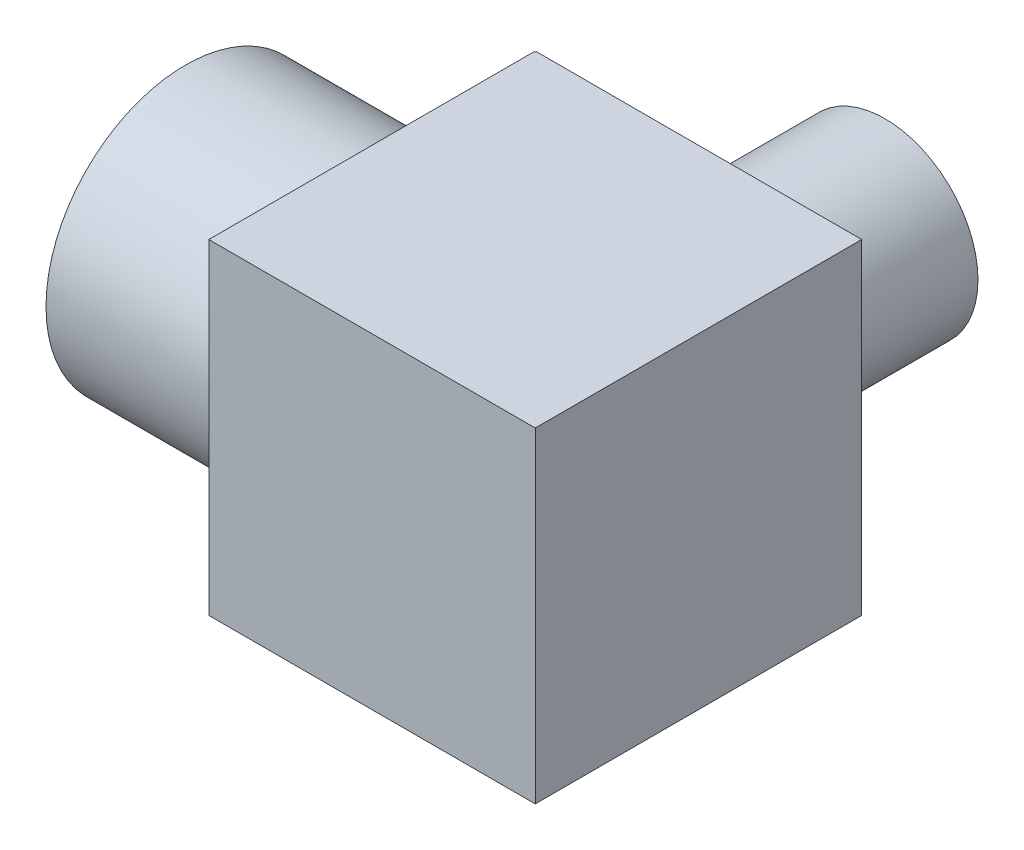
ISO-10303-21;
HEADER;
FILE_DESCRIPTION(('STEP AP214'),'2;1');
FILE_NAME('part.step','',(''),(''),'','','');
FILE_SCHEMA(('AUTOMOTIVE_DESIGN { 1 0 10303 214 1 1 1 1 }'));
ENDSEC;
DATA;
#1=APPLICATION_CONTEXT('core data for automotive mechanical design processes');
#2=APPLICATION_PROTOCOL_DEFINITION('international standard','automotive_design',2000,#1);
#3=PRODUCT_CONTEXT('',#1,'mechanical');
#4=PRODUCT('Part','Part','',(#3));
#5=PRODUCT_RELATED_PRODUCT_CATEGORY('part','',(#4));
#6=PRODUCT_DEFINITION_FORMATION('','',#4);
#7=PRODUCT_DEFINITION_CONTEXT('part definition',#1,'design');
#8=PRODUCT_DEFINITION('design','',#6,#7);
#9=PRODUCT_DEFINITION_SHAPE('','',#8);
#10=(LENGTH_UNIT() NAMED_UNIT(*) SI_UNIT(.MILLI.,.METRE.));
#11=(NAMED_UNIT(*) PLANE_ANGLE_UNIT() SI_UNIT($,.RADIAN.));
#12=(NAMED_UNIT(*) SI_UNIT($,.STERADIAN.) SOLID_ANGLE_UNIT());
#13=UNCERTAINTY_MEASURE_WITH_UNIT(LENGTH_MEASURE(1.E-05),#10,'distance_accuracy_value','');
#14=(GEOMETRIC_REPRESENTATION_CONTEXT(3) GLOBAL_UNCERTAINTY_ASSIGNED_CONTEXT((#13)) GLOBAL_UNIT_ASSIGNED_CONTEXT((#10,
#11,#12)) REPRESENTATION_CONTEXT('',''));
#15=CARTESIAN_POINT('',(0.,0.,0.));
#16=DIRECTION('',(0.,0.,1.));
#17=DIRECTION('',(1.,0.,0.));
#18=AXIS2_PLACEMENT_3D('',#15,#16,#17);
#19=CARTESIAN_POINT('',(17.49425,0.,0.));
#20=DIRECTION('',(1.,0.,0.));
#21=DIRECTION('',(0.,1.,0.));
#22=AXIS2_PLACEMENT_3D('',#19,#20,#21);
#23=PLANE('',#22);
#24=DIRECTION('',(0.,0.,1.));
#25=VECTOR('',#24,1.);
#26=CARTESIAN_POINT('',(17.49425,-5.55625,-5.55625));
#27=LINE('',#26,#25);
#28=CARTESIAN_POINT('',(17.49425,-5.55625,-5.588));
#29=VERTEX_POINT('',#28);
#30=CARTESIAN_POINT('',(17.49425,-5.55625,5.55625));
#31=VERTEX_POINT('',#30);
#32=EDGE_CURVE('E105',#29,#31,#27,.T.);
#33=ORIENTED_EDGE('',*,*,#32,.F.);
#34=DIRECTION('',(0.,1.,0.));
#35=VECTOR('',#34,1.);
#36=CARTESIAN_POINT('',(17.49425,0.,-5.588));
#37=LINE('',#36,#35);
#38=CARTESIAN_POINT('',(17.49425,5.55625,-5.588));
#39=VERTEX_POINT('',#38);
#40=EDGE_CURVE('E81',#39,#29,#37,.F.);
#41=ORIENTED_EDGE('',*,*,#40,.F.);
#42=DIRECTION('',(0.,0.,1.));
#43=VECTOR('',#42,1.);
#44=CARTESIAN_POINT('',(17.49425,5.55625,5.55625));
#45=LINE('',#44,#43);
#46=CARTESIAN_POINT('',(17.49425,5.55625,5.55625));
#47=VERTEX_POINT('',#46);
#48=EDGE_CURVE('E185',#47,#39,#45,.F.);
#49=ORIENTED_EDGE('',*,*,#48,.F.);
#50=DIRECTION('',(0.,-1.,0.));
#51=VECTOR('',#50,1.);
#52=CARTESIAN_POINT('',(17.49425,-5.55625,5.55625));
#53=LINE('',#52,#51);
#54=EDGE_CURVE('E107',#31,#47,#53,.F.);
#55=ORIENTED_EDGE('',*,*,#54,.F.);
#56=EDGE_LOOP('',(#33,#41,#49,#55));
#57=FACE_BOUND('',#56,.T.);
#58=ADVANCED_FACE('F16',(#57),#23,.T.);
#59=CARTESIAN_POINT('',(6.38175,5.55625,0.));
#60=DIRECTION('',(-1.,0.,0.));
#61=DIRECTION('',(0.,-1.,0.));
#62=AXIS2_PLACEMENT_3D('',#59,#60,#61);
#63=PLANE('',#62);
#64=DIRECTION('',(0.,1.,0.));
#65=VECTOR('',#64,1.);
#66=CARTESIAN_POINT('',(6.38175,0.,-5.588));
#67=LINE('',#66,#65);
#68=CARTESIAN_POINT('',(6.38175,-5.55625,-5.588));
#69=VERTEX_POINT('',#68);
#70=CARTESIAN_POINT('',(6.38175,5.55625,-5.588));
#71=VERTEX_POINT('',#70);
#72=EDGE_CURVE('E98',#69,#71,#67,.T.);
#73=ORIENTED_EDGE('',*,*,#72,.F.);
#74=DIRECTION('',(0.,0.,1.));
#75=VECTOR('',#74,1.);
#76=CARTESIAN_POINT('',(6.38175,-5.55625,-5.55625));
#77=LINE('',#76,#75);
#78=CARTESIAN_POINT('',(6.38175,-5.55625,-5.55625));
#79=VERTEX_POINT('',#78);
#80=EDGE_CURVE('E87',#79,#69,#77,.F.);
#81=ORIENTED_EDGE('',*,*,#80,.F.);
#82=DIRECTION('',(0.,1.,0.));
#83=VECTOR('',#82,1.);
#84=CARTESIAN_POINT('',(6.38175,5.55625,-5.55625));
#85=LINE('',#84,#83);
#86=CARTESIAN_POINT('',(6.38175,5.55625,-5.55625));
#87=VERTEX_POINT('',#86);
#88=EDGE_CURVE('E180',#87,#79,#85,.F.);
#89=ORIENTED_EDGE('',*,*,#88,.F.);
#90=DIRECTION('',(0.,0.,1.));
#91=VECTOR('',#90,1.);
#92=CARTESIAN_POINT('',(6.38175,5.55625,5.55625));
#93=LINE('',#92,#91);
#94=EDGE_CURVE('E100',#71,#87,#93,.T.);
#95=ORIENTED_EDGE('',*,*,#94,.F.);
#96=EDGE_LOOP('',(#73,#81,#89,#95));
#97=FACE_BOUND('',#96,.T.);
#98=ADVANCED_FACE('F99',(#97),#63,.T.);
#99=CARTESIAN_POINT('',(14.716125,0.,-5.588));
#100=DIRECTION('',(0.,0.,-1.));
#101=DIRECTION('',(-1.,0.,0.));
#102=AXIS2_PLACEMENT_3D('',#99,#100,#101);
#103=PLANE('',#102);
#104=ORIENTED_EDGE('',*,*,#40,.T.);
#105=DIRECTION('',(1.,0.,0.));
#106=VECTOR('',#105,1.);
#107=CARTESIAN_POINT('',(6.35,-5.55625,-5.588));
#108=LINE('',#107,#106);
#109=EDGE_CURVE('E91',#69,#29,#108,.T.);
#110=ORIENTED_EDGE('',*,*,#109,.F.);
#111=ORIENTED_EDGE('',*,*,#72,.T.);
#112=DIRECTION('',(1.,0.,0.));
#113=VECTOR('',#112,1.);
#114=CARTESIAN_POINT('',(6.35,5.55625,-5.588));
#115=LINE('',#114,#113);
#116=EDGE_CURVE('E183',#39,#71,#115,.F.);
#117=ORIENTED_EDGE('',*,*,#116,.F.);
#118=EDGE_LOOP('',(#104,#110,#111,#117));
#119=FACE_BOUND('',#118,.T.);
#120=CARTESIAN_POINT('',(11.938,0.,-5.588));
#121=DIRECTION('',(0.,0.,-1.));
#122=DIRECTION('',(-1.,0.,0.));
#123=AXIS2_PLACEMENT_3D('',#120,#121,#122);
#124=CIRCLE('',#123,3.175);
#125=CARTESIAN_POINT('',(8.763,0.,-5.588));
#126=VERTEX_POINT('',#125);
#127=EDGE_CURVE('E175',#126,#126,#124,.T.);
#128=ORIENTED_EDGE('',*,*,#127,.F.);
#129=EDGE_LOOP('',(#128));
#130=FACE_BOUND('',#129,.T.);
#131=ADVANCED_FACE('F103',(#119,#130),#103,.T.);
#132=CARTESIAN_POINT('',(6.35,-5.55625,-5.55625));
#133=DIRECTION('',(0.,-1.,0.));
#134=DIRECTION('',(1.,0.,0.));
#135=AXIS2_PLACEMENT_3D('',#132,#133,#134);
#136=PLANE('',#135);
#137=DIRECTION('',(0.,0.,1.));
#138=VECTOR('',#137,1.);
#139=CARTESIAN_POINT('',(6.35,-5.55625,-2.778125));
#140=LINE('',#139,#138);
#141=CARTESIAN_POINT('',(6.35,-5.55625,-5.55625));
#142=VERTEX_POINT('',#141);
#143=CARTESIAN_POINT('',(6.35,-5.55625,5.55625));
#144=VERTEX_POINT('',#143);
#145=EDGE_CURVE('E173',#142,#144,#140,.T.);
#146=ORIENTED_EDGE('',*,*,#145,.F.);
#147=DIRECTION('',(-1.,0.,0.));
#148=VECTOR('',#147,1.);
#149=CARTESIAN_POINT('',(6.35,-5.55625,-5.55625));
#150=LINE('',#149,#148);
#151=EDGE_CURVE('E93',#79,#142,#150,.T.);
#152=ORIENTED_EDGE('',*,*,#151,.F.);
#153=ORIENTED_EDGE('',*,*,#80,.T.);
#154=ORIENTED_EDGE('',*,*,#109,.T.);
#155=ORIENTED_EDGE('',*,*,#32,.T.);
#156=DIRECTION('',(1.,0.,0.));
#157=VECTOR('',#156,1.);
#158=CARTESIAN_POINT('',(6.35,-5.55625,5.55625));
#159=LINE('',#158,#157);
#160=EDGE_CURVE('E190',#144,#31,#159,.T.);
#161=ORIENTED_EDGE('',*,*,#160,.F.);
#162=EDGE_LOOP('',(#146,#152,#153,#154,#155,#161));
#163=FACE_BOUND('',#162,.T.);
#164=ADVANCED_FACE('F90',(#163),#136,.T.);
#165=CARTESIAN_POINT('',(6.35,-5.55625,5.55625));
#166=DIRECTION('',(0.,0.,1.));
#167=DIRECTION('',(0.,-1.,0.));
#168=AXIS2_PLACEMENT_3D('',#165,#166,#167);
#169=PLANE('',#168);
#170=DIRECTION('',(0.,1.,0.));
#171=VECTOR('',#170,1.);
#172=CARTESIAN_POINT('',(6.35,0.,5.55625));
#173=LINE('',#172,#171);
#174=CARTESIAN_POINT('',(6.35,5.55625,5.55625));
#175=VERTEX_POINT('',#174);
#176=EDGE_CURVE('E171',#144,#175,#173,.T.);
#177=ORIENTED_EDGE('',*,*,#176,.F.);
#178=ORIENTED_EDGE('',*,*,#160,.T.);
#179=ORIENTED_EDGE('',*,*,#54,.T.);
#180=DIRECTION('',(1.,0.,0.));
#181=VECTOR('',#180,1.);
#182=CARTESIAN_POINT('',(6.35,5.55625,5.55625));
#183=LINE('',#182,#181);
#184=EDGE_CURVE('E187',#175,#47,#183,.T.);
#185=ORIENTED_EDGE('',*,*,#184,.F.);
#186=EDGE_LOOP('',(#177,#178,#179,#185));
#187=FACE_BOUND('',#186,.T.);
#188=ADVANCED_FACE('F196',(#187),#169,.T.);
#189=CARTESIAN_POINT('',(6.35,5.55625,5.55625));
#190=DIRECTION('',(0.,1.,0.));
#191=DIRECTION('',(0.,0.,1.));
#192=AXIS2_PLACEMENT_3D('',#189,#190,#191);
#193=PLANE('',#192);
#194=ORIENTED_EDGE('',*,*,#116,.T.);
#195=ORIENTED_EDGE('',*,*,#94,.T.);
#196=DIRECTION('',(-1.,0.,0.));
#197=VECTOR('',#196,1.);
#198=CARTESIAN_POINT('',(6.35,5.55625,-5.55625));
#199=LINE('',#198,#197);
#200=CARTESIAN_POINT('',(6.35,5.55625,-5.55625));
#201=VERTEX_POINT('',#200);
#202=EDGE_CURVE('E176',#201,#87,#199,.F.);
#203=ORIENTED_EDGE('',*,*,#202,.F.);
#204=DIRECTION('',(0.,0.,1.));
#205=VECTOR('',#204,1.);
#206=CARTESIAN_POINT('',(6.35,5.55625,-2.778125));
#207=LINE('',#206,#205);
#208=EDGE_CURVE('E169',#175,#201,#207,.F.);
#209=ORIENTED_EDGE('',*,*,#208,.F.);
#210=ORIENTED_EDGE('',*,*,#184,.T.);
#211=ORIENTED_EDGE('',*,*,#48,.T.);
#212=EDGE_LOOP('',(#194,#195,#203,#209,#210,#211));
#213=FACE_BOUND('',#212,.T.);
#214=ADVANCED_FACE('F202',(#213),#193,.T.);
#215=CARTESIAN_POINT('',(6.35,5.55625,-5.55625));
#216=DIRECTION('',(0.,0.,-1.));
#217=DIRECTION('',(-1.,0.,0.));
#218=AXIS2_PLACEMENT_3D('',#215,#216,#217);
#219=PLANE('',#218);
#220=DIRECTION('',(0.,1.,0.));
#221=VECTOR('',#220,1.);
#222=CARTESIAN_POINT('',(6.35,0.,-5.55625));
#223=LINE('',#222,#221);
#224=EDGE_CURVE('E160',#201,#142,#223,.F.);
#225=ORIENTED_EDGE('',*,*,#224,.F.);
#226=ORIENTED_EDGE('',*,*,#202,.T.);
#227=ORIENTED_EDGE('',*,*,#88,.T.);
#228=ORIENTED_EDGE('',*,*,#151,.T.);
#229=EDGE_LOOP('',(#225,#226,#227,#228));
#230=FACE_BOUND('',#229,.T.);
#231=ADVANCED_FACE('F206',(#230),#219,.T.);
#232=CARTESIAN_POINT('',(11.938,0.,-8.763));
#233=DIRECTION('',(0.,0.,-1.));
#234=DIRECTION('',(-1.,0.,0.));
#235=AXIS2_PLACEMENT_3D('',#232,#233,#234);
#236=CYLINDRICAL_SURFACE('',#235,3.175);
#237=CARTESIAN_POINT('',(11.938,0.,-11.938));
#238=DIRECTION('',(0.,0.,-1.));
#239=DIRECTION('',(-1.,0.,0.));
#240=AXIS2_PLACEMENT_3D('',#237,#238,#239);
#241=CIRCLE('',#240,3.175);
#242=CARTESIAN_POINT('',(8.763,0.,-11.938));
#243=VERTEX_POINT('',#242);
#244=EDGE_CURVE('E168',#243,#243,#241,.T.);
#245=ORIENTED_EDGE('',*,*,#244,.F.);
#246=EDGE_LOOP('',(#245));
#247=FACE_BOUND('',#246,.T.);
#248=ORIENTED_EDGE('',*,*,#127,.T.);
#249=EDGE_LOOP('',(#248));
#250=FACE_BOUND('',#249,.T.);
#251=ADVANCED_FACE('F212',(#247,#250),#236,.T.);
#252=CARTESIAN_POINT('',(6.35,0.,-2.778125));
#253=DIRECTION('',(-1.,0.,0.));
#254=DIRECTION('',(0.,0.,1.));
#255=AXIS2_PLACEMENT_3D('',#252,#253,#254);
#256=PLANE('',#255);
#257=ORIENTED_EDGE('',*,*,#208,.T.);
#258=ORIENTED_EDGE('',*,*,#224,.T.);
#259=ORIENTED_EDGE('',*,*,#145,.T.);
#260=ORIENTED_EDGE('',*,*,#176,.T.);
#261=EDGE_LOOP('',(#257,#258,#259,#260));
#262=FACE_BOUND('',#261,.T.);
#263=CARTESIAN_POINT('',(6.35,0.,0.));
#264=DIRECTION('',(-1.,0.,0.));
#265=DIRECTION('',(0.,0.,1.));
#266=AXIS2_PLACEMENT_3D('',#263,#264,#265);
#267=CIRCLE('',#266,4.7625);
#268=CARTESIAN_POINT('',(6.35,0.,4.7625));
#269=VERTEX_POINT('',#268);
#270=EDGE_CURVE('E216',#269,#269,#267,.T.);
#271=ORIENTED_EDGE('',*,*,#270,.F.);
#272=EDGE_LOOP('',(#271));
#273=FACE_BOUND('',#272,.T.);
#274=ADVANCED_FACE('F208',(#262,#273),#256,.T.);
#275=CARTESIAN_POINT('',(13.5255,0.,-11.938));
#276=DIRECTION('',(0.,0.,-1.));
#277=DIRECTION('',(-1.,0.,0.));
#278=AXIS2_PLACEMENT_3D('',#275,#276,#277);
#279=PLANE('',#278);
#280=ORIENTED_EDGE('',*,*,#244,.T.);
#281=EDGE_LOOP('',(#280));
#282=FACE_BOUND('',#281,.T.);
#283=CARTESIAN_POINT('',(11.938,0.,-11.938));
#284=DIRECTION('',(0.,0.,1.));
#285=DIRECTION('',(1.,0.,0.));
#286=AXIS2_PLACEMENT_3D('',#283,#284,#285);
#287=CIRCLE('',#286,2.286);
#288=CARTESIAN_POINT('',(14.224,0.,-11.938));
#289=VERTEX_POINT('',#288);
#290=EDGE_CURVE('E220',#289,#289,#287,.T.);
#291=ORIENTED_EDGE('',*,*,#290,.T.);
#292=EDGE_LOOP('',(#291));
#293=FACE_BOUND('',#292,.T.);
#294=ADVANCED_FACE('F211',(#282,#293),#279,.T.);
#295=CARTESIAN_POINT('',(3.175,0.,0.));
#296=DIRECTION('',(-1.,0.,0.));
#297=DIRECTION('',(0.,0.,1.));
#298=AXIS2_PLACEMENT_3D('',#295,#296,#297);
#299=CYLINDRICAL_SURFACE('',#298,4.7625);
#300=CARTESIAN_POINT('',(0.,0.,0.));
#301=DIRECTION('',(-1.,0.,0.));
#302=DIRECTION('',(0.,0.,1.));
#303=AXIS2_PLACEMENT_3D('',#300,#301,#302);
#304=CIRCLE('',#303,4.7625);
#305=CARTESIAN_POINT('',(0.,0.,4.7625));
#306=VERTEX_POINT('',#305);
#307=EDGE_CURVE('E118',#306,#306,#304,.T.);
#308=ORIENTED_EDGE('',*,*,#307,.F.);
#309=EDGE_LOOP('',(#308));
#310=FACE_BOUND('',#309,.T.);
#311=ORIENTED_EDGE('',*,*,#270,.T.);
#312=EDGE_LOOP('',(#311));
#313=FACE_BOUND('',#312,.T.);
#314=ADVANCED_FACE('F237',(#310,#313),#299,.T.);
#315=CARTESIAN_POINT('',(11.938,0.,-5.969));
#316=DIRECTION('',(0.,0.,1.));
#317=DIRECTION('',(1.,0.,0.));
#318=AXIS2_PLACEMENT_3D('',#315,#316,#317);
#319=CYLINDRICAL_SURFACE('',#318,2.286);
#320=ORIENTED_EDGE('',*,*,#290,.F.);
#321=EDGE_LOOP('',(#320));
#322=FACE_BOUND('',#321,.T.);
#323=CARTESIAN_POINT('',(10.3505,1.64488289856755,-3.50690212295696));
#324=CARTESIAN_POINT('',(10.3728011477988,1.66640650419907,-3.49680692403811));
#325=CARTESIAN_POINT('',(10.3954846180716,1.68743007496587,-3.4864912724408));
#326=CARTESIAN_POINT('',(10.4416655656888,1.7285333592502,-3.46539091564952));
#327=CARTESIAN_POINT('',(10.4651659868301,1.7486088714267,-3.45460446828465));
#328=CARTESIAN_POINT('',(10.5129676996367,1.78779468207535,-3.43256155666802));
#329=CARTESIAN_POINT('',(10.5372724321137,1.80689960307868,-3.42130299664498));
#330=CARTESIAN_POINT('',(10.5866656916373,1.84412557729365,-3.39831191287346));
#331=CARTESIAN_POINT('',(10.6117580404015,1.86224005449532,-3.38657695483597));
#332=CARTESIAN_POINT('',(10.6627071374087,1.89746714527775,-3.36262659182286));
#333=CARTESIAN_POINT('',(10.6885679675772,1.91457197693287,-3.35040842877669));
#334=CARTESIAN_POINT('',(10.7410312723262,1.94776377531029,-3.32548212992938));
#335=CARTESIAN_POINT('',(10.7676379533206,1.96384178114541,-3.31277092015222));
#336=CARTESIAN_POINT('',(10.8215688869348,1.99496314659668,-3.28684734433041));
#337=CARTESIAN_POINT('',(10.8488973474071,2.00999639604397,-3.27363160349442));
#338=CARTESIAN_POINT('',(10.9042386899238,2.0390211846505,-3.24668092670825));
#339=CARTESIAN_POINT('',(10.9322555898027,2.05300161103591,-3.23294227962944));
#340=CARTESIAN_POINT('',(10.988411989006,2.07962442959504,-3.20521134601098));
#341=CARTESIAN_POINT('',(11.0165479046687,2.09227809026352,-3.19122262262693));
#342=CARTESIAN_POINT('',(11.0731048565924,2.11633327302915,-3.16292900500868));
#343=CARTESIAN_POINT('',(11.1015251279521,2.12773749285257,-3.1486248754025));
#344=CARTESIAN_POINT('',(11.15861576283,2.14931318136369,-3.11970235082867));
#345=CARTESIAN_POINT('',(11.1872857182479,2.15948636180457,-3.10508442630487));
#346=CARTESIAN_POINT('',(11.2448452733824,2.17861351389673,-3.07553722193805));
#347=CARTESIAN_POINT('',(11.2737347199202,2.18756826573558,-3.06060814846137));
#348=CARTESIAN_POINT('',(11.3316999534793,2.20427645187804,-3.03043753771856));
#349=CARTESIAN_POINT('',(11.3607757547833,2.21202979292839,-3.01519597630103));
#350=CARTESIAN_POINT('',(11.4190791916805,2.22635546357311,-2.98439629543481));
#351=CARTESIAN_POINT('',(11.4483069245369,2.23292690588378,-2.96883794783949));
#352=CARTESIAN_POINT('',(11.5068795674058,2.24490889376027,-2.93739933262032));
#353=CARTESIAN_POINT('',(11.5362245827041,2.25031784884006,-2.92151865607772));
#354=CARTESIAN_POINT('',(11.5949913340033,2.26000705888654,-2.88942178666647));
#355=CARTESIAN_POINT('',(11.624413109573,2.26428514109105,-2.87320501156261));
#356=CARTESIAN_POINT('',(11.683346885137,2.27171505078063,-2.84042024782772));
#357=CARTESIAN_POINT('',(11.7128588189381,2.27486267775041,-2.82385118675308));
#358=CARTESIAN_POINT('',(11.7714994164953,2.27995620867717,-2.79064353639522));
#359=CARTESIAN_POINT('',(11.8006286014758,2.2819154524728,-2.77400791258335));
#360=CARTESIAN_POINT('',(11.8584767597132,2.28468983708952,-2.74067593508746));
#361=CARTESIAN_POINT('',(11.8871967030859,2.28551740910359,-2.72398229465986));
#362=CARTESIAN_POINT('',(11.9442050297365,2.28607685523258,-2.6905463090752));
#363=CARTESIAN_POINT('',(11.9724947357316,2.28582039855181,-2.67380641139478));
#364=CARTESIAN_POINT('',(12.0286212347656,2.28426335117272,-2.64028600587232));
#365=CARTESIAN_POINT('',(12.0564596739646,2.28297368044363,-2.62350774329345));
#366=CARTESIAN_POINT('',(12.1116637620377,2.27940143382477,-2.58991699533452));
#367=CARTESIAN_POINT('',(12.1390313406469,2.27712908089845,-2.57310659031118));
#368=CARTESIAN_POINT('',(12.1932750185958,2.27164305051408,-2.53945591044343));
#369=CARTESIAN_POINT('',(12.2201532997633,2.26843894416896,-2.52261758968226));
#370=CARTESIAN_POINT('',(12.2734006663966,2.26114101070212,-2.48891400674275));
#371=CARTESIAN_POINT('',(12.2997721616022,2.25705614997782,-2.47205060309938));
#372=CARTESIAN_POINT('',(12.3562974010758,2.24730504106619,-2.43551374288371));
#373=CARTESIAN_POINT('',(12.3864056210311,2.24149194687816,-2.41580887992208));
#374=CARTESIAN_POINT('',(12.4456484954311,2.22883111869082,-2.37654054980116));
#375=CARTESIAN_POINT('',(12.4747907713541,2.22200519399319,-2.35698153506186));
#376=CARTESIAN_POINT('',(12.5320995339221,2.2074010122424,-2.31802421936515));
#377=CARTESIAN_POINT('',(12.5602740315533,2.19964339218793,-2.29862996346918));
#378=CARTESIAN_POINT('',(12.6156480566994,2.18325485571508,-2.2600194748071));
#379=CARTESIAN_POINT('',(12.642855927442,2.17464345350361,-2.24080691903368));
#380=CARTESIAN_POINT('',(12.6963008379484,2.15662276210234,-2.20257515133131));
#381=CARTESIAN_POINT('',(12.7225464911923,2.14723191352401,-2.18355928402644));
#382=CARTESIAN_POINT('',(12.77407418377,2.12772368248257,-2.14573470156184));
#383=CARTESIAN_POINT('',(12.7993650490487,2.11762371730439,-2.12692902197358));
#384=CARTESIAN_POINT('',(12.8489933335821,2.09676482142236,-2.08953675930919));
#385=CARTESIAN_POINT('',(12.8733397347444,2.08602232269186,-2.07095292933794));
#386=CARTESIAN_POINT('',(12.9210920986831,2.06393993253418,-2.03401659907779));
#387=CARTESIAN_POINT('',(12.9445071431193,2.05261556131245,-2.01566655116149));
#388=CARTESIAN_POINT('',(12.9951263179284,2.02705122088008,-1.97545881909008));
#389=CARTESIAN_POINT('',(13.0222344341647,2.0126583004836,-1.95357730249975));
#390=CARTESIAN_POINT('',(13.0752283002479,1.9831422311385,-1.9100709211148));
#391=CARTESIAN_POINT('',(13.101127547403,1.9680385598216,-1.88844926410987));
#392=CARTESIAN_POINT('',(13.1517273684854,1.93718898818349,-1.84546480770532));
#393=CARTESIAN_POINT('',(13.176441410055,1.92146099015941,-1.82410501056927));
#394=CARTESIAN_POINT('',(13.2246981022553,1.88944353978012,-1.78164396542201));
#395=CARTESIAN_POINT('',(13.2482540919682,1.87317045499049,-1.76054552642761));
#396=CARTESIAN_POINT('',(13.2942263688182,1.84013319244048,-1.71860544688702));
#397=CARTESIAN_POINT('',(13.3166557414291,1.82338393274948,-1.69776640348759));
#398=CARTESIAN_POINT('',(13.3604090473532,1.78945582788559,-1.65634270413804));
#399=CARTESIAN_POINT('',(13.3817457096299,1.77229049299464,-1.63576039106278));
#400=CARTESIAN_POINT('',(13.4436169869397,1.7206750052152,-1.57491477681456));
#401=CARTESIAN_POINT('',(13.4831865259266,1.68525778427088,-1.53448165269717));
#402=CARTESIAN_POINT('',(13.558348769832,1.61315151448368,-1.45451846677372));
#403=CARTESIAN_POINT('',(13.5940279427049,1.57653877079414,-1.41500059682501));
#404=CARTESIAN_POINT('',(13.6617840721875,1.5021785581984,-1.33671723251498));
#405=CARTESIAN_POINT('',(13.6939315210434,1.46448703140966,-1.29795962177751));
#406=CARTESIAN_POINT('',(13.7550026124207,1.38796649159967,-1.22094971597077));
#407=CARTESIAN_POINT('',(13.7839758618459,1.34917264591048,-1.18270179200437));
#408=CARTESIAN_POINT('',(13.8390599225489,1.27032797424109,-1.10632559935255));
#409=CARTESIAN_POINT('',(13.8651939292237,1.23029142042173,-1.06819929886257));
#410=CARTESIAN_POINT('',(13.9178821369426,1.14387760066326,-0.986937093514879));
#411=CARTESIAN_POINT('',(13.9440920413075,1.09732649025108,-0.943762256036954));
#412=CARTESIAN_POINT('',(13.9929800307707,1.00283338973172,-0.857514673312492));
#413=CARTESIAN_POINT('',(14.0156761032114,0.954900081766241,-0.814442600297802));
#414=CARTESIAN_POINT('',(14.0576452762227,0.857741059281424,-0.728028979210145));
#415=CARTESIAN_POINT('',(14.0769164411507,0.808514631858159,-0.684687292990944));
#416=CARTESIAN_POINT('',(14.1120934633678,0.708518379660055,-0.597626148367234));
#417=CARTESIAN_POINT('',(14.1279735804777,0.657739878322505,-0.55390625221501));
#418=CARTESIAN_POINT('',(14.1552734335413,0.558561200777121,-0.468917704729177));
#419=CARTESIAN_POINT('',(14.1669076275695,0.51020713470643,-0.427663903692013));
#420=CARTESIAN_POINT('',(14.187081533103,0.41240069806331,-0.344709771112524));
#421=CARTESIAN_POINT('',(14.1955899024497,0.362942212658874,-0.303009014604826));
#422=CARTESIAN_POINT('',(14.2095013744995,0.262306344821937,-0.218578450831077));
#423=CARTESIAN_POINT('',(14.2148210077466,0.211117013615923,-0.175849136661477));
#424=CARTESIAN_POINT('',(14.2221369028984,0.106610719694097,-0.0887633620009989));
#425=CARTESIAN_POINT('',(14.2240018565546,0.0532855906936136,-0.0444056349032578));
#426=CARTESIAN_POINT('',(14.224,0.,0.));
#427=B_SPLINE_CURVE_WITH_KNOTS('',3,(#323,#324,#325,#326,#327,#328,#329,#330,#331,#332,#333,
#334,#335,#336,#337,#338,#339,#340,#341,#342,#343,#344,#345,#346,#347,#348,#349,#350,#351,#352,
#353,#354,#355,#356,#357,#358,#359,#360,#361,#362,#363,#364,#365,#366,#367,#368,#369,#370,#371,
#372,#373,#374,#375,#376,#377,#378,#379,#380,#381,#382,#383,#384,#385,#386,#387,#388,#389,#390,
#391,#392,#393,#394,#395,#396,#397,#398,#399,#400,#401,#402,#403,#404,#405,#406,#407,#408,#409,
#410,#411,#412,#413,#414,#415,#416,#417,#418,#419,#420,#421,#422,#423,#424,#425,#426),
.UNSPECIFIED.,.F.,.F.,(4,2,2,2,2,2,2,2,2,2,2,2,2,2,2,2,2,2,2,2,2,2,2,2,2,2,2,2,2,2,2,2,2,2,2,2,
2,2,2,2,2,2,2,2,2,2,2,2,2,2,2,4),(0.,0.0977816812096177,0.19596234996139,0.294638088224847,
0.393904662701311,0.493856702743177,0.594586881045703,0.69618511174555,0.798737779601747,
0.900333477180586,1.00170530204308,1.10293450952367,1.2040985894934,1.30527051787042,
1.40651808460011,1.50790330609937,1.60948192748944,1.71143417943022,1.81221973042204,
1.91188902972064,2.01048817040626,2.10805875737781,2.20463784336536,2.3002579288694,
2.39494702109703,2.50427397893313,2.61151914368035,2.71671970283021,2.81991055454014,
2.9211250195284,3.02039560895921,3.11775483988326,3.21323609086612,3.32629510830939,
3.43717006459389,3.54591588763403,3.65259346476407,3.75727189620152,3.86003072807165,
4.0601536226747,4.2539100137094,4.44252174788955,4.62755364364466,4.81093759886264,
5.01689605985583,5.22176262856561,5.4267446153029,5.63323120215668,5.82700178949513,
6.02266543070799,6.22324947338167,6.43131235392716),.UNSPECIFIED.);
#428=CARTESIAN_POINT('',(10.3505,1.64488289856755,-3.50690212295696));
#429=VERTEX_POINT('',#428);
#430=CARTESIAN_POINT('',(14.224,0.,0.));
#431=VERTEX_POINT('',#430);
#432=EDGE_CURVE('E218',#429,#431,#427,.T.);
#433=ORIENTED_EDGE('',*,*,#432,.F.);
#434=CARTESIAN_POINT('',(10.3505,1.64488289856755,-3.50690212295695));
#435=CARTESIAN_POINT('',(10.3057266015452,1.60166360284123,-3.52717532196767));
#436=CARTESIAN_POINT('',(10.2626990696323,1.55661257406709,-3.54732919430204));
#437=CARTESIAN_POINT('',(10.1803117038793,1.46295179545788,-3.58697105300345));
#438=CARTESIAN_POINT('',(10.1409539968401,1.41434001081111,-3.60645864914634));
#439=CARTESIAN_POINT('',(10.0282392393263,1.26274628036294,-3.66349071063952));
#440=CARTESIAN_POINT('',(9.9608271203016,1.15456992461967,-3.69932986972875));
#441=CARTESIAN_POINT('',(9.84400113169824,0.925993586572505,-3.7630601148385));
#442=CARTESIAN_POINT('',(9.79466380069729,0.805544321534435,-3.79091729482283));
#443=CARTESIAN_POINT('',(9.73640881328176,0.618900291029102,-3.82426078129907));
#444=CARTESIAN_POINT('',(9.71963239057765,0.555813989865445,-3.83395794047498));
#445=CARTESIAN_POINT('',(9.6914885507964,0.428075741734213,-3.85030975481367));
#446=CARTESIAN_POINT('',(9.68011765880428,0.363424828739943,-3.85696636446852));
#447=CARTESIAN_POINT('',(9.6650525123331,0.248962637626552,-3.86580778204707));
#448=CARTESIAN_POINT('',(9.66016492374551,0.199357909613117,-3.8686857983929));
#449=CARTESIAN_POINT('',(9.65363583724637,0.0998445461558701,-3.87253418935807));
#450=CARTESIAN_POINT('',(9.65199608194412,0.0499357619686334,-3.87350353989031));
#451=CARTESIAN_POINT('',(9.65200920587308,-0.117329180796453,-3.87349168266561));
#452=CARTESIAN_POINT('',(9.66109252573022,-0.234807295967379,-3.86811239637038));
#453=CARTESIAN_POINT('',(9.69696467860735,-0.466175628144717,-3.84710841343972));
#454=CARTESIAN_POINT('',(9.72378440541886,-0.58005922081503,-3.83146584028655));
#455=CARTESIAN_POINT('',(9.79362652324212,-0.800478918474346,-3.79153380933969));
#456=CARTESIAN_POINT('',(9.8365726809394,-0.90704684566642,-3.76728506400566));
#457=CARTESIAN_POINT('',(9.93701310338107,-1.11121518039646,-3.7121953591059));
#458=CARTESIAN_POINT('',(9.99450937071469,-1.20881435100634,-3.68135349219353));
#459=CARTESIAN_POINT('',(10.1015938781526,-1.36351548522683,-3.62618575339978));
#460=CARTESIAN_POINT('',(10.1476984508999,-1.42348510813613,-3.60299100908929));
#461=CARTESIAN_POINT('',(10.2452089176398,-1.53814448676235,-3.55555347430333));
#462=CARTESIAN_POINT('',(10.2965976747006,-1.59285026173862,-3.53131421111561));
#463=CARTESIAN_POINT('',(10.3505,-1.64488289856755,-3.50690212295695));
#464=B_SPLINE_CURVE_WITH_KNOTS('',3,(#434,#435,#436,#437,#438,#439,#440,#441,#442,#443,#444,
#445,#446,#447,#448,#449,#450,#451,#452,#453,#454,#455,#456,#457,#458,#459,#460,#461,#462,#463),
.UNSPECIFIED.,.F.,.F.,(4,2,2,2,2,2,2,2,2,2,2,2,2,2,4),(0.,0.19625046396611,0.392613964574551,
0.787887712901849,1.18481643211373,1.38254334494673,1.5801429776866,1.7297854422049,
1.87950817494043,2.23129705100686,2.5837003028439,2.93445821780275,3.28526443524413,
3.52228831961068,3.75856641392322),.UNSPECIFIED.);
#465=CARTESIAN_POINT('',(10.3505,-1.64488289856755,-3.50690212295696));
#466=VERTEX_POINT('',#465);
#467=EDGE_CURVE('E113',#429,#466,#464,.T.);
#468=ORIENTED_EDGE('',*,*,#467,.T.);
#469=CARTESIAN_POINT('',(14.224,0.,0.));
#470=CARTESIAN_POINT('',(14.2240006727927,-0.0506654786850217,-0.0421820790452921));
#471=CARTESIAN_POINT('',(14.2223167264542,-0.101352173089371,-0.08432592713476));
#472=CARTESIAN_POINT('',(14.2171165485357,-0.179534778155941,-0.149466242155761));
#473=CARTESIAN_POINT('',(14.2147797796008,-0.207108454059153,-0.172466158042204));
#474=CARTESIAN_POINT('',(14.2089473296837,-0.263692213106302,-0.219765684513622));
#475=CARTESIAN_POINT('',(14.2053939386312,-0.292696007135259,-0.244065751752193));
#476=CARTESIAN_POINT('',(14.196956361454,-0.35208694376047,-0.293959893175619));
#477=CARTESIAN_POINT('',(14.1920113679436,-0.382465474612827,-0.319553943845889));
#478=CARTESIAN_POINT('',(14.1806111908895,-0.44454633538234,-0.372018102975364));
#479=CARTESIAN_POINT('',(14.1740922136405,-0.476237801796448,-0.39888719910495));
#480=CARTESIAN_POINT('',(14.1593576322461,-0.540872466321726,-0.453878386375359));
#481=CARTESIAN_POINT('',(14.1510753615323,-0.573802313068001,-0.481998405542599));
#482=CARTESIAN_POINT('',(14.135741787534,-0.629525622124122,-0.529714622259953));
#483=CARTESIAN_POINT('',(14.1290655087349,-0.652399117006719,-0.549339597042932));
#484=CARTESIAN_POINT('',(14.1060762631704,-0.726825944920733,-0.613408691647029));
#485=CARTESIAN_POINT('',(14.0882732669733,-0.777988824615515,-0.657787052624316));
#486=CARTESIAN_POINT('',(14.0576799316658,-0.856707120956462,-0.726915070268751));
#487=CARTESIAN_POINT('',(14.0461381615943,-0.884729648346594,-0.751696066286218));
#488=CARTESIAN_POINT('',(14.0210687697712,-0.942291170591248,-0.802976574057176));
#489=CARTESIAN_POINT('',(14.0074583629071,-0.971796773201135,-0.829473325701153));
#490=CARTESIAN_POINT('',(13.9780140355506,-1.03218654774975,-0.884157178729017));
#491=CARTESIAN_POINT('',(13.9620924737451,-1.06303212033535,-0.912339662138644));
#492=CARTESIAN_POINT('',(13.9277771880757,-1.12594168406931,-0.970361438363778));
#493=CARTESIAN_POINT('',(13.9092911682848,-1.15796144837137,-1.000194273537));
#494=CARTESIAN_POINT('',(13.8800162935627,-1.20598449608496,-1.04533473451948));
#495=CARTESIAN_POINT('',(13.8698085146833,-1.22227409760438,-1.0607177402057));
#496=CARTESIAN_POINT('',(13.8442925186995,-1.26186927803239,-1.0983507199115));
#497=CARTESIAN_POINT('',(13.8287515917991,-1.28504198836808,-1.12058360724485));
#498=CARTESIAN_POINT('',(13.7975309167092,-1.32978572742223,-1.16396227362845));
#499=CARTESIAN_POINT('',(13.7818904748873,-1.35138138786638,-1.18511099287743));
#500=CARTESIAN_POINT('',(13.7468766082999,-1.39799509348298,-1.23120309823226));
#501=CARTESIAN_POINT('',(13.7273456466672,-1.42291214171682,-1.25612906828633));
#502=CARTESIAN_POINT('',(13.6804525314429,-1.48024567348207,-1.31422606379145));
#503=CARTESIAN_POINT('',(13.6526663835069,-1.51236488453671,-1.34734966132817));
#504=CARTESIAN_POINT('',(13.5996080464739,-1.57034435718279,-1.40833237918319));
#505=CARTESIAN_POINT('',(13.5745990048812,-1.59641194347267,-1.43622373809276));
#506=CARTESIAN_POINT('',(13.531749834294,-1.63899547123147,-1.4826597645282));
#507=CARTESIAN_POINT('',(13.5142685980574,-1.65582375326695,-1.50125035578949));
#508=CARTESIAN_POINT('',(13.4716523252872,-1.69553403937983,-1.54576904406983));
#509=CARTESIAN_POINT('',(13.4462436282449,-1.71815570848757,-1.57166852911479));
#510=CARTESIAN_POINT('',(13.3952420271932,-1.76155183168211,-1.62240137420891));
#511=CARTESIAN_POINT('',(13.3696861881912,-1.78236315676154,-1.64724051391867));
#512=CARTESIAN_POINT('',(13.318534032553,-1.82220718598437,-1.69585354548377));
#513=CARTESIAN_POINT('',(13.292972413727,-1.84127696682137,-1.71963354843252));
#514=CARTESIAN_POINT('',(13.2419437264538,-1.87771466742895,-1.76612819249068));
#515=CARTESIAN_POINT('',(13.216509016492,-1.89511958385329,-1.78884936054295));
#516=CARTESIAN_POINT('',(13.1658603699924,-1.92830284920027,-1.83323484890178));
#517=CARTESIAN_POINT('',(13.140676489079,-1.9441181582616,-1.854905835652));
#518=CARTESIAN_POINT('',(13.0906471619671,-1.97419650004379,-1.89720580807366));
#519=CARTESIAN_POINT('',(13.06582950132,-1.98849648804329,-1.91784137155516));
#520=CARTESIAN_POINT('',(13.0166419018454,-2.015620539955,-1.95808736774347));
#521=CARTESIAN_POINT('',(12.9922975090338,-2.02848146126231,-1.97770420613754));
#522=CARTESIAN_POINT('',(12.9358799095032,-2.05697053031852,-2.02252137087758));
#523=CARTESIAN_POINT('',(12.9036261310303,-2.07230973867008,-2.04767897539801));
#524=CARTESIAN_POINT('',(12.8389339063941,-2.1012002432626,-2.09725728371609));
#525=CARTESIAN_POINT('',(12.8065123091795,-2.11478136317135,-2.12168261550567));
#526=CARTESIAN_POINT('',(12.7415790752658,-2.14021493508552,-2.16978815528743));
#527=CARTESIAN_POINT('',(12.7090827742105,-2.15209700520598,-2.19347339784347));
#528=CARTESIAN_POINT('',(12.6440904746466,-2.1741886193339,-2.24009700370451));
#529=CARTESIAN_POINT('',(12.6116083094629,-2.18442761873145,-2.2630406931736));
#530=CARTESIAN_POINT('',(12.5467286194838,-2.20329151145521,-2.30818212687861));
#531=CARTESIAN_POINT('',(12.5143434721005,-2.21194562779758,-2.33038544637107));
#532=CARTESIAN_POINT('',(12.4497367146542,-2.2276984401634,-2.37405050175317));
#533=CARTESIAN_POINT('',(12.4175260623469,-2.23482609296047,-2.39551800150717));
#534=CARTESIAN_POINT('',(12.3533417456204,-2.24758488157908,-2.43771875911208));
#535=CARTESIAN_POINT('',(12.3213776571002,-2.25324467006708,-2.45845791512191));
#536=CARTESIAN_POINT('',(12.2577546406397,-2.26312632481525,-2.49921216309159));
#537=CARTESIAN_POINT('',(12.2261039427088,-2.26737650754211,-2.51923323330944));
#538=CARTESIAN_POINT('',(12.1631707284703,-2.27449690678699,-2.55856407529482));
#539=CARTESIAN_POINT('',(12.1318951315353,-2.27739507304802,-2.57787985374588));
#540=CARTESIAN_POINT('',(12.0697701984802,-2.28186830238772,-2.61581530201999));
#541=CARTESIAN_POINT('',(12.0389265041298,-2.28347092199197,-2.63444095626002));
#542=CARTESIAN_POINT('',(11.9777185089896,-2.28540885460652,-2.67101334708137));
#543=CARTESIAN_POINT('',(11.9473586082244,-2.28577129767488,-2.68896600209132));
#544=CARTESIAN_POINT('',(11.8871671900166,-2.28528207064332,-2.72421206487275));
#545=CARTESIAN_POINT('',(11.8573388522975,-2.28445709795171,-2.74151126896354));
#546=CARTESIAN_POINT('',(11.7982533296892,-2.28164786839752,-2.7754697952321));
#547=CARTESIAN_POINT('',(11.7689981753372,-2.27968976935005,-2.79213479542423));
#548=CARTESIAN_POINT('',(11.7111039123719,-2.2746542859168,-2.82485295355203));
#549=CARTESIAN_POINT('',(11.6824655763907,-2.27160276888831,-2.84091147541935));
#550=CARTESIAN_POINT('',(11.6169548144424,-2.26334636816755,-2.87735281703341));
#551=CARTESIAN_POINT('',(11.5800815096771,-2.25777465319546,-2.89765196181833));
#552=CARTESIAN_POINT('',(11.507105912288,-2.24493205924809,-2.93739315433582));
#553=CARTESIAN_POINT('',(11.4710023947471,-2.23769581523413,-2.95684417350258));
#554=CARTESIAN_POINT('',(11.3996215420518,-2.22159048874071,-2.9949208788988));
#555=CARTESIAN_POINT('',(11.3643413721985,-2.21275443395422,-3.01355519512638));
#556=CARTESIAN_POINT('',(11.2946486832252,-2.1935269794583,-3.05002201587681));
#557=CARTESIAN_POINT('',(11.2602320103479,-2.18316659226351,-3.06786292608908));
#558=CARTESIAN_POINT('',(11.1923023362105,-2.16095856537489,-3.10277022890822));
#559=CARTESIAN_POINT('',(11.1587840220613,-2.14913988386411,-3.11984469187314));
#560=CARTESIAN_POINT('',(11.0926799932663,-2.12407888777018,-3.15324641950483));
#561=CARTESIAN_POINT('',(11.060088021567,-2.11086333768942,-3.16958137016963));
#562=CARTESIAN_POINT('',(10.9958594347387,-2.08306612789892,-3.20153175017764));
#563=CARTESIAN_POINT('',(10.9642158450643,-2.06850891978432,-3.21715441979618));
#564=CARTESIAN_POINT('',(10.9019008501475,-2.03807998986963,-3.24770752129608));
#565=CARTESIAN_POINT('',(10.8712220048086,-2.02223028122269,-3.26264469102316));
#566=CARTESIAN_POINT('',(10.8108478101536,-1.98926179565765,-3.29185319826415));
#567=CARTESIAN_POINT('',(10.781144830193,-1.97216247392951,-3.30613071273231));
#568=CARTESIAN_POINT('',(10.7227285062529,-1.93673403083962,-3.33404486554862));
#569=CARTESIAN_POINT('',(10.6940076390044,-1.91842169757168,-3.34768705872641));
#570=CARTESIAN_POINT('',(10.6375569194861,-1.88060025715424,-3.37435352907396));
#571=CARTESIAN_POINT('',(10.6098199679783,-1.86110518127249,-3.38738267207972));
#572=CARTESIAN_POINT('',(10.555333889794,-1.82094528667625,-3.41284340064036));
#573=CARTESIAN_POINT('',(10.5285784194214,-1.80029167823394,-3.42527908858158));
#574=CARTESIAN_POINT('',(10.4760485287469,-1.75783514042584,-3.44957023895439));
#575=CARTESIAN_POINT('',(10.4502688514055,-1.73604057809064,-3.46142895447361));
#576=CARTESIAN_POINT('',(10.3996782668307,-1.69131876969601,-3.48457937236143));
#577=CARTESIAN_POINT('',(10.3748635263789,-1.66839705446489,-3.49587338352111));
#578=CARTESIAN_POINT('',(10.3505,-1.64488289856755,-3.50690212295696));
#579=B_SPLINE_CURVE_WITH_KNOTS('',3,(#469,#470,#471,#472,#473,#474,#475,#476,#477,#478,#479,
#480,#481,#482,#483,#484,#485,#486,#487,#488,#489,#490,#491,#492,#493,#494,#495,#496,#497,#498,
#499,#500,#501,#502,#503,#504,#505,#506,#507,#508,#509,#510,#511,#512,#513,#514,#515,#516,#517,
#518,#519,#520,#521,#522,#523,#524,#525,#526,#527,#528,#529,#530,#531,#532,#533,#534,#535,#536,
#537,#538,#539,#540,#541,#542,#543,#544,#545,#546,#547,#548,#549,#550,#551,#552,#553,#554,#555,
#556,#557,#558,#559,#560,#561,#562,#563,#564,#565,#566,#567,#568,#569,#570,#571,#572,#573,#574,
#575,#576,#577,#578),.UNSPECIFIED.,.F.,.F.,(4,2,2,2,2,2,2,2,2,2,2,2,2,2,2,2,2,2,2,2,2,2,2,2,2,2,
2,2,2,2,2,2,2,2,2,2,2,2,2,2,2,2,2,2,2,2,2,2,2,2,2,2,2,2,4),(0.,0.197739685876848,
0.305675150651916,0.419671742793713,0.53974085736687,0.665890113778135,0.798123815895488,
0.890725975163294,1.10068427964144,1.21811373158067,1.34387112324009,1.47798114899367,
1.62046732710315,1.69432638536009,1.80133886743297,1.90342632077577,2.0242882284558,
2.1858125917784,2.32269569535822,2.41439053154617,2.54263042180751,2.6664152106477,
2.78573583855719,2.90058468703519,3.01095575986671,3.11684486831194,3.21824982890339,
3.34927349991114,3.47765420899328,3.60341538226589,3.7265812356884,3.84717700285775,
3.96522918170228,4.08076580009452,4.19381670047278,4.30441384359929,4.41259163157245,
4.51838725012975,4.62184103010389,4.72299682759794,4.82190242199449,4.94923477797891,
5.07412521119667,5.1966826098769,5.31702394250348,5.43527503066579,5.55157126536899,
5.6660582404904,5.77889227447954,5.89024078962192,6.0002825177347,6.1092075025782,
6.21721687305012,6.32452236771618,6.43134560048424),.UNSPECIFIED.);
#580=EDGE_CURVE('E36',#466,#431,#579,.F.);
#581=ORIENTED_EDGE('',*,*,#580,.T.);
#582=EDGE_LOOP('',(#433,#468,#581));
#583=FACE_BOUND('',#582,.T.);
#584=ADVANCED_FACE('F126',(#322,#583),#319,.F.);
#585=CARTESIAN_POINT('',(10.3505,0.,0.));
#586=DIRECTION('',(0.858125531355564,0.481444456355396,0.178414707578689));
#587=DIRECTION('',(-0.445188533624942,0.870802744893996,-0.208589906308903));
#588=AXIS2_PLACEMENT_3D('',#585,#586,#587);
#589=SPHERICAL_SURFACE('',#588,3.8735);
#590=ORIENTED_EDGE('',*,*,#580,.F.);
#591=CARTESIAN_POINT('',(10.3505,0.,0.));
#592=DIRECTION('',(1.,0.,0.));
#593=DIRECTION('',(0.,0.,-1.));
#594=AXIS2_PLACEMENT_3D('',#591,#592,#593);
#595=CIRCLE('',#594,3.8735);
#596=EDGE_CURVE('E27',#466,#429,#595,.F.);
#597=ORIENTED_EDGE('',*,*,#596,.T.);
#598=ORIENTED_EDGE('',*,*,#432,.T.);
#599=EDGE_LOOP('',(#590,#597,#598));
#600=FACE_BOUND('',#599,.T.);
#601=CARTESIAN_POINT('',(13.6744492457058,1.86487510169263,0.691089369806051));
#602=VERTEX_POINT('',#601);
#603=VERTEX_LOOP('',#602);
#604=FACE_BOUND('',#603,.T.);
#605=ADVANCED_FACE('F137',(#600,#604),#589,.F.);
#606=CARTESIAN_POINT('',(0.,0.,-2.38125));
#607=DIRECTION('',(-1.,0.,0.));
#608=DIRECTION('',(0.,0.,1.));
#609=AXIS2_PLACEMENT_3D('',#606,#607,#608);
#610=PLANE('',#609);
#611=ORIENTED_EDGE('',*,*,#307,.T.);
#612=EDGE_LOOP('',(#611));
#613=FACE_BOUND('',#612,.T.);
#614=CARTESIAN_POINT('',(0.,0.,0.));
#615=DIRECTION('',(1.,0.,0.));
#616=DIRECTION('',(0.,0.,-1.));
#617=AXIS2_PLACEMENT_3D('',#614,#615,#616);
#618=CIRCLE('',#617,3.8735);
#619=CARTESIAN_POINT('',(0.,0.,-3.8735));
#620=VERTEX_POINT('',#619);
#621=EDGE_CURVE('E11',#620,#620,#618,.T.);
#622=ORIENTED_EDGE('',*,*,#621,.T.);
#623=EDGE_LOOP('',(#622));
#624=FACE_BOUND('',#623,.T.);
#625=ADVANCED_FACE('F134',(#613,#624),#610,.T.);
#626=CARTESIAN_POINT('',(5.17525,0.,0.));
#627=DIRECTION('',(1.,0.,0.));
#628=DIRECTION('',(0.,0.,-1.));
#629=AXIS2_PLACEMENT_3D('',#626,#627,#628);
#630=CYLINDRICAL_SURFACE('',#629,3.8735);
#631=ORIENTED_EDGE('',*,*,#621,.F.);
#632=EDGE_LOOP('',(#631));
#633=FACE_BOUND('',#632,.T.);
#634=ORIENTED_EDGE('',*,*,#467,.F.);
#635=ORIENTED_EDGE('',*,*,#596,.F.);
#636=EDGE_LOOP('',(#634,#635));
#637=FACE_BOUND('',#636,.T.);
#638=ADVANCED_FACE('F130',(#633,#637),#630,.F.);
#639=CLOSED_SHELL('',(#58,#98,#131,#164,#188,#214,#231,#251,#274,#294,#314,#584,#605,#625,#638));
#640=MANIFOLD_SOLID_BREP('B1',#639);
#641=ADVANCED_BREP_SHAPE_REPRESENTATION('',(#18,#640),#14);
#642=SHAPE_DEFINITION_REPRESENTATION(#9,#641);
ENDSEC;
END-ISO-10303-21;
